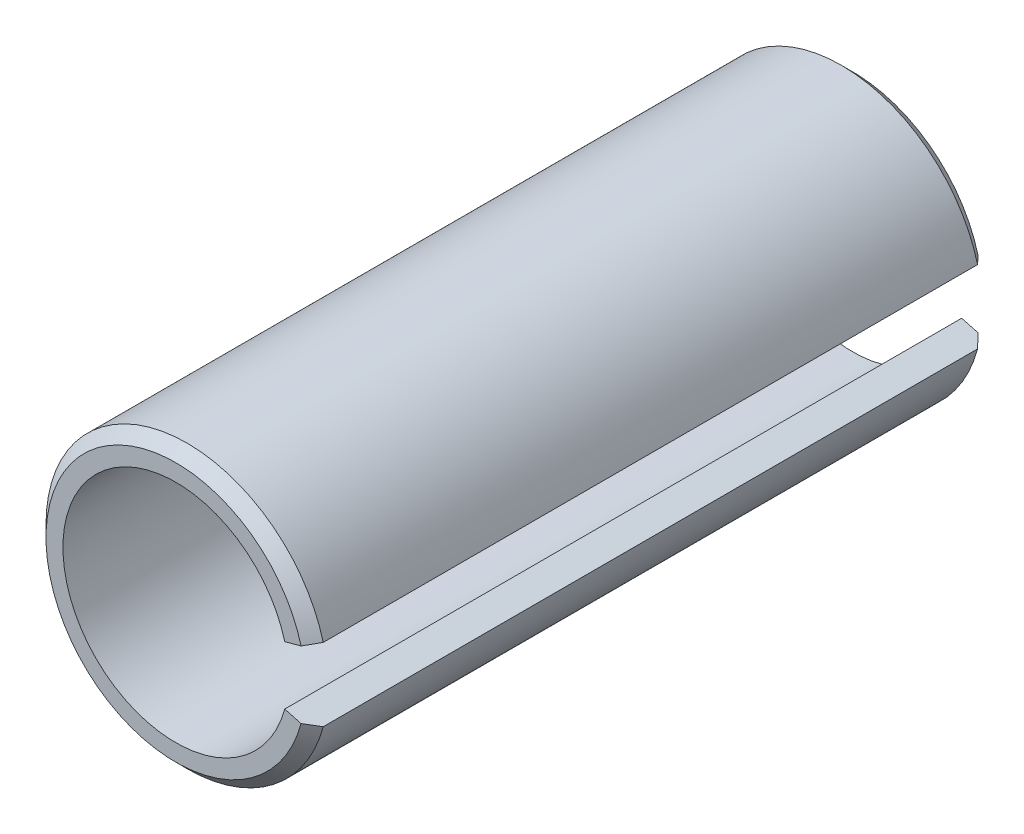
ISO-10303-21;
HEADER;
FILE_DESCRIPTION(('STEP AP214'),'2;1');
FILE_NAME('part.step','',(''),(''),'','','');
FILE_SCHEMA(('AUTOMOTIVE_DESIGN { 1 0 10303 214 1 1 1 1 }'));
ENDSEC;
DATA;
#1=APPLICATION_CONTEXT('core data for automotive mechanical design processes');
#2=APPLICATION_PROTOCOL_DEFINITION('international standard','automotive_design',2000,#1);
#3=PRODUCT_CONTEXT('',#1,'mechanical');
#4=PRODUCT('Part','Part','',(#3));
#5=PRODUCT_RELATED_PRODUCT_CATEGORY('part','',(#4));
#6=PRODUCT_DEFINITION_FORMATION('','',#4);
#7=PRODUCT_DEFINITION_CONTEXT('part definition',#1,'design');
#8=PRODUCT_DEFINITION('design','',#6,#7);
#9=PRODUCT_DEFINITION_SHAPE('','',#8);
#10=(LENGTH_UNIT() NAMED_UNIT(*) SI_UNIT(.MILLI.,.METRE.));
#11=(NAMED_UNIT(*) PLANE_ANGLE_UNIT() SI_UNIT($,.RADIAN.));
#12=(NAMED_UNIT(*) SI_UNIT($,.STERADIAN.) SOLID_ANGLE_UNIT());
#13=UNCERTAINTY_MEASURE_WITH_UNIT(LENGTH_MEASURE(1.E-05),#10,'distance_accuracy_value','');
#14=(GEOMETRIC_REPRESENTATION_CONTEXT(3) GLOBAL_UNCERTAINTY_ASSIGNED_CONTEXT((#13)) GLOBAL_UNIT_ASSIGNED_CONTEXT((#10,
#11,#12)) REPRESENTATION_CONTEXT('',''));
#15=CARTESIAN_POINT('',(0.,0.,0.));
#16=DIRECTION('',(0.,0.,1.));
#17=DIRECTION('',(1.,0.,0.));
#18=AXIS2_PLACEMENT_3D('',#15,#16,#17);
#19=CARTESIAN_POINT('',(0.,0.,-6.));
#20=DIRECTION('',(0.,0.,1.));
#21=DIRECTION('',(1.,0.,0.));
#22=AXIS2_PLACEMENT_3D('',#19,#20,#21);
#23=CYLINDRICAL_SURFACE('',#22,1.25);
#24=DIRECTION('',(0.,0.,1.));
#25=VECTOR('',#24,1.);
#26=CARTESIAN_POINT('',(1.20740728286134,0.323523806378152,-6.));
#27=LINE('',#26,#25);
#28=CARTESIAN_POINT('',(1.20740728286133,0.323523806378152,-5.9));
#29=VERTEX_POINT('',#28);
#30=CARTESIAN_POINT('',(1.20740728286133,0.323523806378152,-0.0999999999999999));
#31=VERTEX_POINT('',#30);
#32=EDGE_CURVE('E116',#29,#31,#27,.T.);
#33=ORIENTED_EDGE('',*,*,#32,.F.);
#34=CARTESIAN_POINT('',(0.,0.,-5.9));
#35=DIRECTION('',(0.,0.,1.));
#36=DIRECTION('',(1.,0.,0.));
#37=AXIS2_PLACEMENT_3D('',#34,#35,#36);
#38=CIRCLE('',#37,1.25);
#39=CARTESIAN_POINT('',(1.20740728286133,-0.323523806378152,-5.9));
#40=VERTEX_POINT('',#39);
#41=EDGE_CURVE('E123',#29,#40,#38,.T.);
#42=ORIENTED_EDGE('',*,*,#41,.T.);
#43=DIRECTION('',(0.,0.,1.));
#44=VECTOR('',#43,1.);
#45=CARTESIAN_POINT('',(1.20740728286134,-0.323523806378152,-6.));
#46=LINE('',#45,#44);
#47=CARTESIAN_POINT('',(1.20740728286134,-0.323523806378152,-0.100000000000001));
#48=VERTEX_POINT('',#47);
#49=EDGE_CURVE('E104',#40,#48,#46,.T.);
#50=ORIENTED_EDGE('',*,*,#49,.T.);
#51=CARTESIAN_POINT('',(0.,0.,-0.100000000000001));
#52=DIRECTION('',(0.,0.,1.));
#53=DIRECTION('',(1.,0.,0.));
#54=AXIS2_PLACEMENT_3D('',#51,#52,#53);
#55=CIRCLE('',#54,1.25);
#56=EDGE_CURVE('E118',#48,#31,#55,.F.);
#57=ORIENTED_EDGE('',*,*,#56,.T.);
#58=EDGE_LOOP('',(#33,#42,#50,#57));
#59=FACE_BOUND('',#58,.T.);
#60=ADVANCED_FACE('F31',(#59),#23,.T.);
#61=CARTESIAN_POINT('',(0.965925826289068,0.258819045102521,-6.));
#62=DIRECTION('',(0.258819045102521,-0.965925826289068,0.));
#63=DIRECTION('',(0.965925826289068,0.258819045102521,0.));
#64=AXIS2_PLACEMENT_3D('',#61,#62,#63);
#65=PLANE('',#64);
#66=DIRECTION('',(0.965925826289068,0.258819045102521,0.));
#67=VECTOR('',#66,1.);
#68=CARTESIAN_POINT('',(0.965925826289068,0.258819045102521,-6.));
#69=LINE('',#68,#67);
#70=CARTESIAN_POINT('',(0.965925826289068,0.258819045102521,-6.));
#71=VERTEX_POINT('',#70);
#72=CARTESIAN_POINT('',(1.11081470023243,0.297641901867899,-6.));
#73=VERTEX_POINT('',#72);
#74=EDGE_CURVE('E114',#71,#73,#69,.T.);
#75=ORIENTED_EDGE('',*,*,#74,.T.);
#76=DIRECTION('',(0.68301270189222,0.18301270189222,0.707106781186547));
#77=VECTOR('',#76,1.);
#78=CARTESIAN_POINT('',(0.,0.,-7.15));
#79=LINE('',#78,#77);
#80=EDGE_CURVE('E38',#73,#29,#79,.T.);
#81=ORIENTED_EDGE('',*,*,#80,.T.);
#82=ORIENTED_EDGE('',*,*,#32,.T.);
#83=DIRECTION('',(-0.683012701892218,-0.18301270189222,0.707106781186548));
#84=VECTOR('',#83,1.);
#85=CARTESIAN_POINT('',(0.,0.,1.15));
#86=LINE('',#85,#84);
#87=CARTESIAN_POINT('',(1.11081470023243,0.297641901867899,0.));
#88=VERTEX_POINT('',#87);
#89=EDGE_CURVE('E45',#31,#88,#86,.T.);
#90=ORIENTED_EDGE('',*,*,#89,.T.);
#91=DIRECTION('',(0.965925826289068,0.258819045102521,0.));
#92=VECTOR('',#91,1.);
#93=CARTESIAN_POINT('',(0.965925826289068,0.258819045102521,0.));
#94=LINE('',#93,#92);
#95=CARTESIAN_POINT('',(0.965925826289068,0.258819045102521,0.));
#96=VERTEX_POINT('',#95);
#97=EDGE_CURVE('E107',#96,#88,#94,.T.);
#98=ORIENTED_EDGE('',*,*,#97,.F.);
#99=DIRECTION('',(0.,0.,1.));
#100=VECTOR('',#99,1.);
#101=CARTESIAN_POINT('',(0.965925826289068,0.258819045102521,-6.));
#102=LINE('',#101,#100);
#103=EDGE_CURVE('E103',#71,#96,#102,.T.);
#104=ORIENTED_EDGE('',*,*,#103,.F.);
#105=EDGE_LOOP('',(#75,#81,#82,#90,#98,#104));
#106=FACE_BOUND('',#105,.T.);
#107=ADVANCED_FACE('F133',(#106),#65,.T.);
#108=CARTESIAN_POINT('',(0.,0.,-6.));
#109=DIRECTION('',(0.,0.,1.));
#110=DIRECTION('',(1.,0.,0.));
#111=AXIS2_PLACEMENT_3D('',#108,#109,#110);
#112=CYLINDRICAL_SURFACE('',#111,1.);
#113=CARTESIAN_POINT('',(0.,0.,0.));
#114=DIRECTION('',(0.,0.,-1.));
#115=DIRECTION('',(1.,0.,0.));
#116=AXIS2_PLACEMENT_3D('',#113,#114,#115);
#117=CIRCLE('',#116,1.);
#118=CARTESIAN_POINT('',(0.965925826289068,-0.258819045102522,0.));
#119=VERTEX_POINT('',#118);
#120=EDGE_CURVE('E91',#119,#96,#117,.T.);
#121=ORIENTED_EDGE('',*,*,#120,.F.);
#122=DIRECTION('',(0.,0.,1.));
#123=VECTOR('',#122,1.);
#124=CARTESIAN_POINT('',(0.965925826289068,-0.258819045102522,-6.));
#125=LINE('',#124,#123);
#126=CARTESIAN_POINT('',(0.965925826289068,-0.258819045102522,-6.));
#127=VERTEX_POINT('',#126);
#128=EDGE_CURVE('E96',#127,#119,#125,.T.);
#129=ORIENTED_EDGE('',*,*,#128,.F.);
#130=CARTESIAN_POINT('',(0.,0.,-6.));
#131=DIRECTION('',(0.,0.,-1.));
#132=DIRECTION('',(1.,0.,0.));
#133=AXIS2_PLACEMENT_3D('',#130,#131,#132);
#134=CIRCLE('',#133,1.);
#135=EDGE_CURVE('E112',#127,#71,#134,.T.);
#136=ORIENTED_EDGE('',*,*,#135,.T.);
#137=ORIENTED_EDGE('',*,*,#103,.T.);
#138=EDGE_LOOP('',(#121,#129,#136,#137));
#139=FACE_BOUND('',#138,.T.);
#140=ADVANCED_FACE('F106',(#139),#112,.F.);
#141=CARTESIAN_POINT('',(0.965925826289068,-0.258819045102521,-6.));
#142=DIRECTION('',(0.258819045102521,0.965925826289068,0.));
#143=DIRECTION('',(-0.965925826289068,0.258819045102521,0.));
#144=AXIS2_PLACEMENT_3D('',#141,#142,#143);
#145=PLANE('',#144);
#146=ORIENTED_EDGE('',*,*,#49,.F.);
#147=DIRECTION('',(-0.68301270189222,0.18301270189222,-0.707106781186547));
#148=VECTOR('',#147,1.);
#149=CARTESIAN_POINT('',(0.,0.,-7.15));
#150=LINE('',#149,#148);
#151=CARTESIAN_POINT('',(1.11081470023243,-0.297641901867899,-6.));
#152=VERTEX_POINT('',#151);
#153=EDGE_CURVE('E128',#40,#152,#150,.T.);
#154=ORIENTED_EDGE('',*,*,#153,.T.);
#155=DIRECTION('',(-0.965925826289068,0.258819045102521,0.));
#156=VECTOR('',#155,1.);
#157=CARTESIAN_POINT('',(0.965925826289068,-0.258819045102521,-6.));
#158=LINE('',#157,#156);
#159=EDGE_CURVE('E99',#152,#127,#158,.T.);
#160=ORIENTED_EDGE('',*,*,#159,.T.);
#161=ORIENTED_EDGE('',*,*,#128,.T.);
#162=DIRECTION('',(-0.965925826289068,0.258819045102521,0.));
#163=VECTOR('',#162,1.);
#164=CARTESIAN_POINT('',(0.965925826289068,-0.258819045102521,0.));
#165=LINE('',#164,#163);
#166=CARTESIAN_POINT('',(1.11081470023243,-0.297641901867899,0.));
#167=VERTEX_POINT('',#166);
#168=EDGE_CURVE('E87',#167,#119,#165,.T.);
#169=ORIENTED_EDGE('',*,*,#168,.F.);
#170=DIRECTION('',(0.683012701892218,-0.18301270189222,-0.707106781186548));
#171=VECTOR('',#170,1.);
#172=CARTESIAN_POINT('',(0.,0.,1.15));
#173=LINE('',#172,#171);
#174=EDGE_CURVE('E126',#167,#48,#173,.T.);
#175=ORIENTED_EDGE('',*,*,#174,.T.);
#176=EDGE_LOOP('',(#146,#154,#160,#161,#169,#175));
#177=FACE_BOUND('',#176,.T.);
#178=ADVANCED_FACE('F98',(#177),#145,.T.);
#179=CARTESIAN_POINT('',(0.,0.,-6.));
#180=DIRECTION('',(0.,0.,1.));
#181=DIRECTION('',(1.,0.,0.));
#182=AXIS2_PLACEMENT_3D('',#179,#180,#181);
#183=PLANE('',#182);
#184=ORIENTED_EDGE('',*,*,#159,.F.);
#185=CARTESIAN_POINT('',(0.,0.,-6.));
#186=DIRECTION('',(0.,0.,1.));
#187=DIRECTION('',(1.,0.,0.));
#188=AXIS2_PLACEMENT_3D('',#185,#186,#187);
#189=CIRCLE('',#188,1.15);
#190=EDGE_CURVE('E53',#152,#73,#189,.F.);
#191=ORIENTED_EDGE('',*,*,#190,.T.);
#192=ORIENTED_EDGE('',*,*,#74,.F.);
#193=ORIENTED_EDGE('',*,*,#135,.F.);
#194=EDGE_LOOP('',(#184,#191,#192,#193));
#195=FACE_BOUND('',#194,.T.);
#196=ADVANCED_FACE('F139',(#195),#183,.F.);
#197=CARTESIAN_POINT('',(0.,0.,0.));
#198=DIRECTION('',(0.,0.,1.));
#199=DIRECTION('',(1.,0.,0.));
#200=AXIS2_PLACEMENT_3D('',#197,#198,#199);
#201=PLANE('',#200);
#202=ORIENTED_EDGE('',*,*,#97,.T.);
#203=CARTESIAN_POINT('',(0.,0.,0.));
#204=DIRECTION('',(0.,0.,1.));
#205=DIRECTION('',(1.,0.,0.));
#206=AXIS2_PLACEMENT_3D('',#203,#204,#205);
#207=CIRCLE('',#206,1.15);
#208=EDGE_CURVE('E11',#88,#167,#207,.T.);
#209=ORIENTED_EDGE('',*,*,#208,.T.);
#210=ORIENTED_EDGE('',*,*,#168,.T.);
#211=ORIENTED_EDGE('',*,*,#120,.T.);
#212=EDGE_LOOP('',(#202,#209,#210,#211));
#213=FACE_BOUND('',#212,.T.);
#214=ADVANCED_FACE('F89',(#213),#201,.T.);
#215=CARTESIAN_POINT('',(0.,0.,-5.9));
#216=DIRECTION('',(0.,0.,1.));
#217=DIRECTION('',(1.,0.,0.));
#218=AXIS2_PLACEMENT_3D('',#215,#216,#217);
#219=CONICAL_SURFACE('',#218,1.25,0.785398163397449);
#220=ORIENTED_EDGE('',*,*,#80,.F.);
#221=ORIENTED_EDGE('',*,*,#190,.F.);
#222=ORIENTED_EDGE('',*,*,#153,.F.);
#223=ORIENTED_EDGE('',*,*,#41,.F.);
#224=EDGE_LOOP('',(#220,#221,#222,#223));
#225=FACE_BOUND('',#224,.T.);
#226=ADVANCED_FACE('F138',(#225),#219,.T.);
#227=CARTESIAN_POINT('',(0.,0.,0.));
#228=DIRECTION('',(0.,0.,-1.));
#229=DIRECTION('',(-1.,0.,0.));
#230=AXIS2_PLACEMENT_3D('',#227,#228,#229);
#231=CONICAL_SURFACE('',#230,1.15,0.785398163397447);
#232=ORIENTED_EDGE('',*,*,#89,.F.);
#233=ORIENTED_EDGE('',*,*,#56,.F.);
#234=ORIENTED_EDGE('',*,*,#174,.F.);
#235=ORIENTED_EDGE('',*,*,#208,.F.);
#236=EDGE_LOOP('',(#232,#233,#234,#235));
#237=FACE_BOUND('',#236,.T.);
#238=ADVANCED_FACE('F183',(#237),#231,.T.);
#239=CLOSED_SHELL('',(#60,#107,#140,#178,#196,#214,#226,#238));
#240=MANIFOLD_SOLID_BREP('B2',#239);
#241=ADVANCED_BREP_SHAPE_REPRESENTATION('',(#18,#240),#14);
#242=SHAPE_DEFINITION_REPRESENTATION(#9,#241);
ENDSEC;
END-ISO-10303-21;
